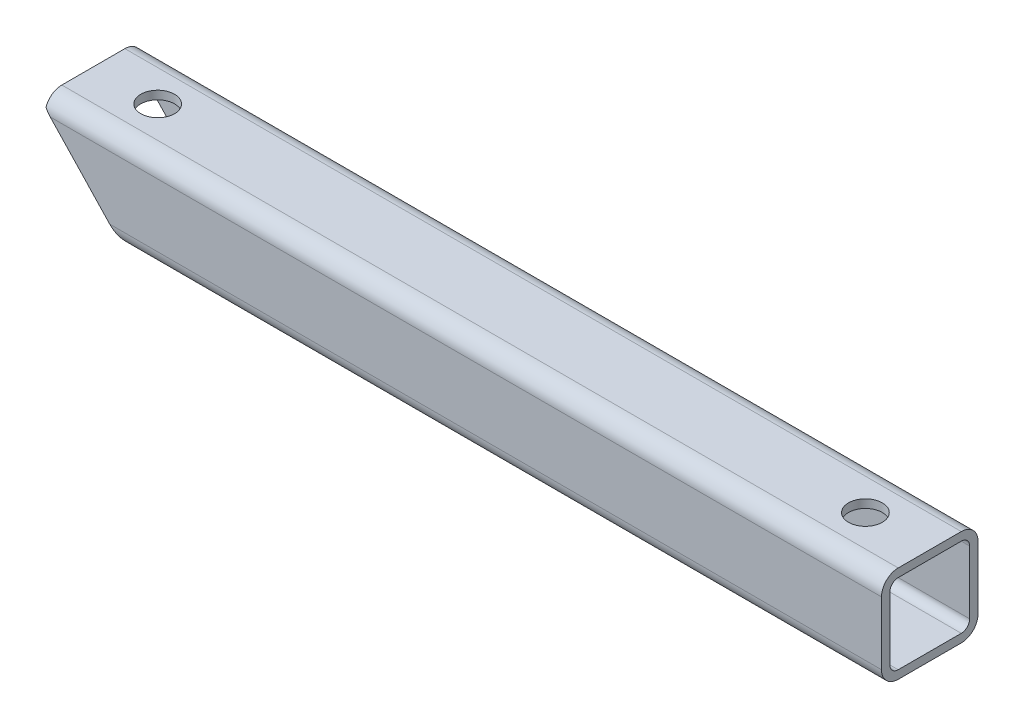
ISO-10303-21;
HEADER;
FILE_DESCRIPTION(('STEP AP214'),'2;1');
FILE_NAME('part.step','',(''),(''),'','','');
FILE_SCHEMA(('AUTOMOTIVE_DESIGN { 1 0 10303 214 1 1 1 1 }'));
ENDSEC;
DATA;
#1=APPLICATION_CONTEXT('core data for automotive mechanical design processes');
#2=APPLICATION_PROTOCOL_DEFINITION('international standard','automotive_design',2000,#1);
#3=PRODUCT_CONTEXT('',#1,'mechanical');
#4=PRODUCT('Part','Part','',(#3));
#5=PRODUCT_RELATED_PRODUCT_CATEGORY('part','',(#4));
#6=PRODUCT_DEFINITION_FORMATION('','',#4);
#7=PRODUCT_DEFINITION_CONTEXT('part definition',#1,'design');
#8=PRODUCT_DEFINITION('design','',#6,#7);
#9=PRODUCT_DEFINITION_SHAPE('','',#8);
#10=(LENGTH_UNIT() NAMED_UNIT(*) SI_UNIT(.MILLI.,.METRE.));
#11=(NAMED_UNIT(*) PLANE_ANGLE_UNIT() SI_UNIT($,.RADIAN.));
#12=(NAMED_UNIT(*) SI_UNIT($,.STERADIAN.) SOLID_ANGLE_UNIT());
#13=UNCERTAINTY_MEASURE_WITH_UNIT(LENGTH_MEASURE(1.E-05),#10,'distance_accuracy_value','');
#14=(GEOMETRIC_REPRESENTATION_CONTEXT(3) GLOBAL_UNCERTAINTY_ASSIGNED_CONTEXT((#13)) GLOBAL_UNIT_ASSIGNED_CONTEXT((#10,
#11,#12)) REPRESENTATION_CONTEXT('',''));
#15=CARTESIAN_POINT('',(0.,0.,0.));
#16=DIRECTION('',(0.,0.,1.));
#17=DIRECTION('',(1.,0.,0.));
#18=AXIS2_PLACEMENT_3D('',#15,#16,#17);
#19=CARTESIAN_POINT('',(130.,9.8,-9.8));
#20=DIRECTION('',(-1.,0.,0.));
#21=DIRECTION('',(0.,0.,1.));
#22=AXIS2_PLACEMENT_3D('',#19,#20,#21);
#23=CYLINDRICAL_SURFACE('',#22,5.2);
#24=DIRECTION('',(-1.,0.,0.));
#25=VECTOR('',#24,1.);
#26=CARTESIAN_POINT('',(130.,9.8,-15.));
#27=LINE('',#26,#25);
#28=CARTESIAN_POINT('',(130.,9.8,-15.));
#29=VERTEX_POINT('',#28);
#30=CARTESIAN_POINT('',(-128.396226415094,9.8,-15.));
#31=VERTEX_POINT('',#30);
#32=EDGE_CURVE('E186',#29,#31,#27,.T.);
#33=ORIENTED_EDGE('',*,*,#32,.T.);
#34=CARTESIAN_POINT('',(-128.396226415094,9.8,-9.8));
#35=DIRECTION('',(0.727393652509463,0.686220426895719,0.));
#36=DIRECTION('',(-0.686220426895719,0.727393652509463,0.));
#37=AXIS2_PLACEMENT_3D('',#34,#35,#36);
#38=ELLIPSE('',#37,7.14881135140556,5.2);
#39=CARTESIAN_POINT('',(-130.,11.5,-14.7142649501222));
#40=VERTEX_POINT('',#39);
#41=EDGE_CURVE('E168',#31,#40,#38,.T.);
#42=ORIENTED_EDGE('',*,*,#41,.T.);
#43=CARTESIAN_POINT('',(-130.,9.8,-9.8));
#44=DIRECTION('',(1.,0.,0.));
#45=DIRECTION('',(0.,0.,-1.));
#46=AXIS2_PLACEMENT_3D('',#43,#44,#45);
#47=CIRCLE('',#46,5.2);
#48=CARTESIAN_POINT('',(-130.,15.,-9.8));
#49=VERTEX_POINT('',#48);
#50=EDGE_CURVE('E277',#40,#49,#47,.T.);
#51=ORIENTED_EDGE('',*,*,#50,.T.);
#52=DIRECTION('',(-1.,0.,0.));
#53=VECTOR('',#52,1.);
#54=CARTESIAN_POINT('',(130.,15.,-9.8));
#55=LINE('',#54,#53);
#56=CARTESIAN_POINT('',(130.,15.,-9.8));
#57=VERTEX_POINT('',#56);
#58=EDGE_CURVE('E219',#57,#49,#55,.T.);
#59=ORIENTED_EDGE('',*,*,#58,.F.);
#60=CARTESIAN_POINT('',(130.,9.8,-9.8));
#61=DIRECTION('',(1.,0.,0.));
#62=DIRECTION('',(0.,0.,-1.));
#63=AXIS2_PLACEMENT_3D('',#60,#61,#62);
#64=CIRCLE('',#63,5.2);
#65=EDGE_CURVE('E194',#29,#57,#64,.T.);
#66=ORIENTED_EDGE('',*,*,#65,.F.);
#67=EDGE_LOOP('',(#33,#42,#51,#59,#66));
#68=FACE_BOUND('',#67,.T.);
#69=ADVANCED_FACE('F34',(#68),#23,.T.);
#70=CARTESIAN_POINT('',(130.,15.,-9.8));
#71=DIRECTION('',(0.,-1.,0.));
#72=DIRECTION('',(0.,0.,-1.));
#73=AXIS2_PLACEMENT_3D('',#70,#71,#72);
#74=PLANE('',#73);
#75=CARTESIAN_POINT('',(-110.,15.,0.));
#76=DIRECTION('',(0.,1.,0.));
#77=DIRECTION('',(0.,0.,1.));
#78=AXIS2_PLACEMENT_3D('',#75,#76,#77);
#79=CIRCLE('',#78,5.25);
#80=CARTESIAN_POINT('',(-110.,15.,5.25));
#81=VERTEX_POINT('',#80);
#82=EDGE_CURVE('E178',#81,#81,#79,.T.);
#83=ORIENTED_EDGE('',*,*,#82,.F.);
#84=EDGE_LOOP('',(#83));
#85=FACE_BOUND('',#84,.T.);
#86=CARTESIAN_POINT('',(110.,15.,0.));
#87=DIRECTION('',(0.,1.,0.));
#88=DIRECTION('',(0.,0.,1.));
#89=AXIS2_PLACEMENT_3D('',#86,#87,#88);
#90=CIRCLE('',#89,5.25);
#91=CARTESIAN_POINT('',(110.,15.,5.25));
#92=VERTEX_POINT('',#91);
#93=EDGE_CURVE('E253',#92,#92,#90,.T.);
#94=ORIENTED_EDGE('',*,*,#93,.F.);
#95=EDGE_LOOP('',(#94));
#96=FACE_BOUND('',#95,.T.);
#97=DIRECTION('',(0.,0.,1.));
#98=VECTOR('',#97,1.);
#99=CARTESIAN_POINT('',(-130.,15.,-9.8));
#100=LINE('',#99,#98);
#101=CARTESIAN_POINT('',(-130.,15.,9.8));
#102=VERTEX_POINT('',#101);
#103=EDGE_CURVE('E279',#49,#102,#100,.T.);
#104=ORIENTED_EDGE('',*,*,#103,.T.);
#105=DIRECTION('',(-1.,0.,0.));
#106=VECTOR('',#105,1.);
#107=CARTESIAN_POINT('',(130.,15.,9.8));
#108=LINE('',#107,#106);
#109=CARTESIAN_POINT('',(130.,15.,9.8));
#110=VERTEX_POINT('',#109);
#111=EDGE_CURVE('E216',#110,#102,#108,.T.);
#112=ORIENTED_EDGE('',*,*,#111,.F.);
#113=DIRECTION('',(0.,0.,1.));
#114=VECTOR('',#113,1.);
#115=CARTESIAN_POINT('',(130.,15.,-9.8));
#116=LINE('',#115,#114);
#117=EDGE_CURVE('E309',#57,#110,#116,.T.);
#118=ORIENTED_EDGE('',*,*,#117,.F.);
#119=ORIENTED_EDGE('',*,*,#58,.T.);
#120=EDGE_LOOP('',(#104,#112,#118,#119));
#121=FACE_BOUND('',#120,.T.);
#122=ADVANCED_FACE('F325',(#85,#96,#121),#74,.F.);
#123=CARTESIAN_POINT('',(130.,9.8,9.8));
#124=DIRECTION('',(-1.,0.,0.));
#125=DIRECTION('',(0.,0.,1.));
#126=AXIS2_PLACEMENT_3D('',#123,#124,#125);
#127=CYLINDRICAL_SURFACE('',#126,5.2);
#128=CARTESIAN_POINT('',(-130.,9.8,9.8));
#129=DIRECTION('',(1.,0.,0.));
#130=DIRECTION('',(0.,0.,-1.));
#131=AXIS2_PLACEMENT_3D('',#128,#129,#130);
#132=CIRCLE('',#131,5.2);
#133=CARTESIAN_POINT('',(-130.,11.5,14.7142649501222));
#134=VERTEX_POINT('',#133);
#135=EDGE_CURVE('E281',#102,#134,#132,.T.);
#136=ORIENTED_EDGE('',*,*,#135,.T.);
#137=CARTESIAN_POINT('',(-128.396226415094,9.8,9.8));
#138=DIRECTION('',(0.727393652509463,0.686220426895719,0.));
#139=DIRECTION('',(-0.686220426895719,0.727393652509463,0.));
#140=AXIS2_PLACEMENT_3D('',#137,#138,#139);
#141=ELLIPSE('',#140,7.14881135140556,5.2);
#142=CARTESIAN_POINT('',(-128.396226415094,9.80000000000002,15.));
#143=VERTEX_POINT('',#142);
#144=EDGE_CURVE('E179',#134,#143,#141,.T.);
#145=ORIENTED_EDGE('',*,*,#144,.T.);
#146=DIRECTION('',(-1.,0.,0.));
#147=VECTOR('',#146,1.);
#148=CARTESIAN_POINT('',(130.,9.8,15.));
#149=LINE('',#148,#147);
#150=CARTESIAN_POINT('',(130.,9.8,15.));
#151=VERTEX_POINT('',#150);
#152=EDGE_CURVE('E213',#151,#143,#149,.T.);
#153=ORIENTED_EDGE('',*,*,#152,.F.);
#154=CARTESIAN_POINT('',(130.,9.8,9.8));
#155=DIRECTION('',(1.,0.,0.));
#156=DIRECTION('',(0.,0.,-1.));
#157=AXIS2_PLACEMENT_3D('',#154,#155,#156);
#158=CIRCLE('',#157,5.2);
#159=EDGE_CURVE('E311',#110,#151,#158,.T.);
#160=ORIENTED_EDGE('',*,*,#159,.F.);
#161=ORIENTED_EDGE('',*,*,#111,.T.);
#162=EDGE_LOOP('',(#136,#145,#153,#160,#161));
#163=FACE_BOUND('',#162,.T.);
#164=ADVANCED_FACE('F330',(#163),#127,.T.);
#165=CARTESIAN_POINT('',(130.,-9.8,15.));
#166=DIRECTION('',(0.,0.,-1.));
#167=DIRECTION('',(-1.,0.,0.));
#168=AXIS2_PLACEMENT_3D('',#165,#166,#167);
#169=PLANE('',#168);
#170=ORIENTED_EDGE('',*,*,#152,.T.);
#171=DIRECTION('',(0.686220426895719,-0.727393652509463,0.));
#172=VECTOR('',#171,1.);
#173=CARTESIAN_POINT('',(-130.,11.5,15.));
#174=LINE('',#173,#172);
#175=CARTESIAN_POINT('',(-109.905660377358,-9.8,15.));
#176=VERTEX_POINT('',#175);
#177=EDGE_CURVE('E190',#143,#176,#174,.T.);
#178=ORIENTED_EDGE('',*,*,#177,.T.);
#179=DIRECTION('',(-1.,0.,0.));
#180=VECTOR('',#179,1.);
#181=CARTESIAN_POINT('',(130.,-9.8,15.));
#182=LINE('',#181,#180);
#183=CARTESIAN_POINT('',(130.,-9.8,15.));
#184=VERTEX_POINT('',#183);
#185=EDGE_CURVE('E210',#184,#176,#182,.T.);
#186=ORIENTED_EDGE('',*,*,#185,.F.);
#187=DIRECTION('',(0.,-1.,0.));
#188=VECTOR('',#187,1.);
#189=CARTESIAN_POINT('',(130.,-9.8,15.));
#190=LINE('',#189,#188);
#191=EDGE_CURVE('E313',#151,#184,#190,.T.);
#192=ORIENTED_EDGE('',*,*,#191,.F.);
#193=EDGE_LOOP('',(#170,#178,#186,#192));
#194=FACE_BOUND('',#193,.T.);
#195=ADVANCED_FACE('F338',(#194),#169,.F.);
#196=CARTESIAN_POINT('',(130.,-9.8,9.8));
#197=DIRECTION('',(-1.,0.,0.));
#198=DIRECTION('',(0.,0.,1.));
#199=AXIS2_PLACEMENT_3D('',#196,#197,#198);
#200=CYLINDRICAL_SURFACE('',#199,5.2);
#201=ORIENTED_EDGE('',*,*,#185,.T.);
#202=CARTESIAN_POINT('',(-109.905660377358,-9.8,9.8));
#203=DIRECTION('',(0.727393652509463,0.686220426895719,0.));
#204=DIRECTION('',(-0.686220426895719,0.727393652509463,0.));
#205=AXIS2_PLACEMENT_3D('',#202,#203,#204);
#206=ELLIPSE('',#205,7.14881135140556,5.2);
#207=CARTESIAN_POINT('',(-105.,-15.,9.8));
#208=VERTEX_POINT('',#207);
#209=EDGE_CURVE('E343',#176,#208,#206,.T.);
#210=ORIENTED_EDGE('',*,*,#209,.T.);
#211=DIRECTION('',(-1.,0.,0.));
#212=VECTOR('',#211,1.);
#213=CARTESIAN_POINT('',(130.,-15.,9.8));
#214=LINE('',#213,#212);
#215=CARTESIAN_POINT('',(130.,-15.,9.8));
#216=VERTEX_POINT('',#215);
#217=EDGE_CURVE('E207',#216,#208,#214,.T.);
#218=ORIENTED_EDGE('',*,*,#217,.F.);
#219=CARTESIAN_POINT('',(130.,-9.8,9.8));
#220=DIRECTION('',(1.,0.,0.));
#221=DIRECTION('',(0.,0.,-1.));
#222=AXIS2_PLACEMENT_3D('',#219,#220,#221);
#223=CIRCLE('',#222,5.2);
#224=EDGE_CURVE('E315',#184,#216,#223,.T.);
#225=ORIENTED_EDGE('',*,*,#224,.F.);
#226=EDGE_LOOP('',(#201,#210,#218,#225));
#227=FACE_BOUND('',#226,.T.);
#228=ADVANCED_FACE('F341',(#227),#200,.T.);
#229=CARTESIAN_POINT('',(130.,-15.,9.8));
#230=DIRECTION('',(0.,1.,0.));
#231=DIRECTION('',(0.,0.,1.));
#232=AXIS2_PLACEMENT_3D('',#229,#230,#231);
#233=PLANE('',#232);
#234=ORIENTED_EDGE('',*,*,#217,.T.);
#235=DIRECTION('',(0.,0.,-1.));
#236=VECTOR('',#235,1.);
#237=CARTESIAN_POINT('',(-105.,-15.,15.));
#238=LINE('',#237,#236);
#239=CARTESIAN_POINT('',(-105.,-15.,1.60078105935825));
#240=VERTEX_POINT('',#239);
#241=EDGE_CURVE('E365',#208,#240,#238,.T.);
#242=ORIENTED_EDGE('',*,*,#241,.T.);
#243=CARTESIAN_POINT('',(-110.,-15.,0.));
#244=DIRECTION('',(0.,1.,0.));
#245=DIRECTION('',(0.,0.,1.));
#246=AXIS2_PLACEMENT_3D('',#243,#244,#245);
#247=CIRCLE('',#246,5.25);
#248=CARTESIAN_POINT('',(-105.,-15.,-1.60078105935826));
#249=VERTEX_POINT('',#248);
#250=EDGE_CURVE('E249',#240,#249,#247,.T.);
#251=ORIENTED_EDGE('',*,*,#250,.T.);
#252=CARTESIAN_POINT('',(-105.,-15.,-9.8));
#253=VERTEX_POINT('',#252);
#254=EDGE_CURVE('E49',#249,#253,#238,.T.);
#255=ORIENTED_EDGE('',*,*,#254,.T.);
#256=DIRECTION('',(-1.,0.,0.));
#257=VECTOR('',#256,1.);
#258=CARTESIAN_POINT('',(130.,-15.,-9.8));
#259=LINE('',#258,#257);
#260=CARTESIAN_POINT('',(130.,-15.,-9.8));
#261=VERTEX_POINT('',#260);
#262=EDGE_CURVE('E197',#261,#253,#259,.T.);
#263=ORIENTED_EDGE('',*,*,#262,.F.);
#264=DIRECTION('',(0.,0.,-1.));
#265=VECTOR('',#264,1.);
#266=CARTESIAN_POINT('',(130.,-15.,9.8));
#267=LINE('',#266,#265);
#268=EDGE_CURVE('E317',#216,#261,#267,.T.);
#269=ORIENTED_EDGE('',*,*,#268,.F.);
#270=EDGE_LOOP('',(#234,#242,#251,#255,#263,#269));
#271=FACE_BOUND('',#270,.T.);
#272=CARTESIAN_POINT('',(110.,-15.,0.));
#273=DIRECTION('',(0.,1.,0.));
#274=DIRECTION('',(0.,0.,1.));
#275=AXIS2_PLACEMENT_3D('',#272,#273,#274);
#276=CIRCLE('',#275,5.25);
#277=CARTESIAN_POINT('',(110.,-15.,5.25));
#278=VERTEX_POINT('',#277);
#279=EDGE_CURVE('E245',#278,#278,#276,.T.);
#280=ORIENTED_EDGE('',*,*,#279,.T.);
#281=EDGE_LOOP('',(#280));
#282=FACE_BOUND('',#281,.T.);
#283=ADVANCED_FACE('F345',(#271,#282),#233,.F.);
#284=CARTESIAN_POINT('',(130.,-9.8,-9.8));
#285=DIRECTION('',(-1.,0.,0.));
#286=DIRECTION('',(0.,0.,1.));
#287=AXIS2_PLACEMENT_3D('',#284,#285,#286);
#288=CYLINDRICAL_SURFACE('',#287,5.2);
#289=ORIENTED_EDGE('',*,*,#262,.T.);
#290=CARTESIAN_POINT('',(-109.905660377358,-9.8,-9.8));
#291=DIRECTION('',(0.727393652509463,0.686220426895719,0.));
#292=DIRECTION('',(-0.686220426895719,0.727393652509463,0.));
#293=AXIS2_PLACEMENT_3D('',#290,#291,#292);
#294=ELLIPSE('',#293,7.14881135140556,5.2);
#295=CARTESIAN_POINT('',(-109.905660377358,-9.8,-15.));
#296=VERTEX_POINT('',#295);
#297=EDGE_CURVE('E349',#253,#296,#294,.T.);
#298=ORIENTED_EDGE('',*,*,#297,.T.);
#299=DIRECTION('',(-1.,0.,0.));
#300=VECTOR('',#299,1.);
#301=CARTESIAN_POINT('',(130.,-9.8,-15.));
#302=LINE('',#301,#300);
#303=CARTESIAN_POINT('',(130.,-9.8,-15.));
#304=VERTEX_POINT('',#303);
#305=EDGE_CURVE('E189',#304,#296,#302,.T.);
#306=ORIENTED_EDGE('',*,*,#305,.F.);
#307=CARTESIAN_POINT('',(130.,-9.8,-9.8));
#308=DIRECTION('',(1.,0.,0.));
#309=DIRECTION('',(0.,0.,-1.));
#310=AXIS2_PLACEMENT_3D('',#307,#308,#309);
#311=CIRCLE('',#310,5.2);
#312=EDGE_CURVE('E318',#261,#304,#311,.T.);
#313=ORIENTED_EDGE('',*,*,#312,.F.);
#314=EDGE_LOOP('',(#289,#298,#306,#313));
#315=FACE_BOUND('',#314,.T.);
#316=ADVANCED_FACE('F348',(#315),#288,.T.);
#317=CARTESIAN_POINT('',(130.,9.8,9.8));
#318=DIRECTION('',(-1.,0.,0.));
#319=DIRECTION('',(0.,0.,1.));
#320=AXIS2_PLACEMENT_3D('',#317,#318,#319);
#321=CYLINDRICAL_SURFACE('',#320,2.6);
#322=CARTESIAN_POINT('',(-128.396226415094,9.8,9.8));
#323=DIRECTION('',(0.727393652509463,0.686220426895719,0.));
#324=DIRECTION('',(-0.686220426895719,0.727393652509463,0.));
#325=AXIS2_PLACEMENT_3D('',#322,#323,#324);
#326=ELLIPSE('',#325,3.57440567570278,2.6);
#327=CARTESIAN_POINT('',(-130.,11.5,11.7672315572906));
#328=VERTEX_POINT('',#327);
#329=CARTESIAN_POINT('',(-128.396226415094,9.8,12.4));
#330=VERTEX_POINT('',#329);
#331=EDGE_CURVE('E375',#328,#330,#326,.T.);
#332=ORIENTED_EDGE('',*,*,#331,.F.);
#333=CARTESIAN_POINT('',(-130.,9.8,9.8));
#334=DIRECTION('',(1.,0.,0.));
#335=DIRECTION('',(0.,0.,-1.));
#336=AXIS2_PLACEMENT_3D('',#333,#334,#335);
#337=CIRCLE('',#336,2.6);
#338=CARTESIAN_POINT('',(-130.,12.4,9.8));
#339=VERTEX_POINT('',#338);
#340=EDGE_CURVE('E269',#339,#328,#337,.T.);
#341=ORIENTED_EDGE('',*,*,#340,.F.);
#342=DIRECTION('',(-1.,0.,0.));
#343=VECTOR('',#342,1.);
#344=CARTESIAN_POINT('',(130.,12.4,9.8));
#345=LINE('',#344,#343);
#346=CARTESIAN_POINT('',(130.,12.4,9.8));
#347=VERTEX_POINT('',#346);
#348=EDGE_CURVE('E195',#347,#339,#345,.T.);
#349=ORIENTED_EDGE('',*,*,#348,.F.);
#350=CARTESIAN_POINT('',(130.,9.8,9.8));
#351=DIRECTION('',(1.,0.,0.));
#352=DIRECTION('',(0.,0.,-1.));
#353=AXIS2_PLACEMENT_3D('',#350,#351,#352);
#354=CIRCLE('',#353,2.6);
#355=CARTESIAN_POINT('',(130.,9.8,12.4));
#356=VERTEX_POINT('',#355);
#357=EDGE_CURVE('E284',#347,#356,#354,.T.);
#358=ORIENTED_EDGE('',*,*,#357,.T.);
#359=DIRECTION('',(-1.,0.,0.));
#360=VECTOR('',#359,1.);
#361=CARTESIAN_POINT('',(130.,9.8,12.4));
#362=LINE('',#361,#360);
#363=EDGE_CURVE('E222',#356,#330,#362,.T.);
#364=ORIENTED_EDGE('',*,*,#363,.T.);
#365=EDGE_LOOP('',(#332,#341,#349,#358,#364));
#366=FACE_BOUND('',#365,.T.);
#367=ADVANCED_FACE('F36',(#366),#321,.F.);
#368=CARTESIAN_POINT('',(130.,12.4,-9.8));
#369=DIRECTION('',(0.,-1.,0.));
#370=DIRECTION('',(0.,0.,-1.));
#371=AXIS2_PLACEMENT_3D('',#368,#369,#370);
#372=PLANE('',#371);
#373=CARTESIAN_POINT('',(-110.,12.4,0.));
#374=DIRECTION('',(0.,-1.,0.));
#375=DIRECTION('',(0.,0.,-1.));
#376=AXIS2_PLACEMENT_3D('',#373,#374,#375);
#377=CIRCLE('',#376,5.25);
#378=CARTESIAN_POINT('',(-110.,12.4,-5.25));
#379=VERTEX_POINT('',#378);
#380=EDGE_CURVE('E248',#379,#379,#377,.T.);
#381=ORIENTED_EDGE('',*,*,#380,.F.);
#382=EDGE_LOOP('',(#381));
#383=FACE_BOUND('',#382,.T.);
#384=CARTESIAN_POINT('',(110.,12.4,0.));
#385=DIRECTION('',(0.,-1.,0.));
#386=DIRECTION('',(0.,0.,-1.));
#387=AXIS2_PLACEMENT_3D('',#384,#385,#386);
#388=CIRCLE('',#387,5.25);
#389=CARTESIAN_POINT('',(110.,12.4,-5.25));
#390=VERTEX_POINT('',#389);
#391=EDGE_CURVE('E244',#390,#390,#388,.T.);
#392=ORIENTED_EDGE('',*,*,#391,.F.);
#393=EDGE_LOOP('',(#392));
#394=FACE_BOUND('',#393,.T.);
#395=DIRECTION('',(0.,0.,1.));
#396=VECTOR('',#395,1.);
#397=CARTESIAN_POINT('',(-130.,12.4,-9.8));
#398=LINE('',#397,#396);
#399=CARTESIAN_POINT('',(-130.,12.4,-9.8));
#400=VERTEX_POINT('',#399);
#401=EDGE_CURVE('E272',#400,#339,#398,.T.);
#402=ORIENTED_EDGE('',*,*,#401,.F.);
#403=DIRECTION('',(-1.,0.,0.));
#404=VECTOR('',#403,1.);
#405=CARTESIAN_POINT('',(130.,12.4,-9.8));
#406=LINE('',#405,#404);
#407=CARTESIAN_POINT('',(130.,12.4,-9.8));
#408=VERTEX_POINT('',#407);
#409=EDGE_CURVE('E199',#408,#400,#406,.T.);
#410=ORIENTED_EDGE('',*,*,#409,.F.);
#411=DIRECTION('',(0.,0.,1.));
#412=VECTOR('',#411,1.);
#413=CARTESIAN_POINT('',(130.,12.4,-9.8));
#414=LINE('',#413,#412);
#415=EDGE_CURVE('E287',#408,#347,#414,.T.);
#416=ORIENTED_EDGE('',*,*,#415,.T.);
#417=ORIENTED_EDGE('',*,*,#348,.T.);
#418=EDGE_LOOP('',(#402,#410,#416,#417));
#419=FACE_BOUND('',#418,.T.);
#420=ADVANCED_FACE('F410',(#383,#394,#419),#372,.T.);
#421=CARTESIAN_POINT('',(130.,9.8,-9.8));
#422=DIRECTION('',(-1.,0.,0.));
#423=DIRECTION('',(0.,0.,1.));
#424=AXIS2_PLACEMENT_3D('',#421,#422,#423);
#425=CYLINDRICAL_SURFACE('',#424,2.6);
#426=CARTESIAN_POINT('',(-128.396226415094,9.8,-9.8));
#427=DIRECTION('',(0.727393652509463,0.686220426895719,0.));
#428=DIRECTION('',(-0.686220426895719,0.727393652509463,0.));
#429=AXIS2_PLACEMENT_3D('',#426,#427,#428);
#430=ELLIPSE('',#429,3.57440567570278,2.6);
#431=CARTESIAN_POINT('',(-128.396226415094,9.8,-12.4));
#432=VERTEX_POINT('',#431);
#433=CARTESIAN_POINT('',(-130.,11.5,-11.7672315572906));
#434=VERTEX_POINT('',#433);
#435=EDGE_CURVE('E350',#432,#434,#430,.T.);
#436=ORIENTED_EDGE('',*,*,#435,.F.);
#437=DIRECTION('',(-1.,0.,0.));
#438=VECTOR('',#437,1.);
#439=CARTESIAN_POINT('',(130.,9.8,-12.4));
#440=LINE('',#439,#438);
#441=CARTESIAN_POINT('',(130.,9.8,-12.4));
#442=VERTEX_POINT('',#441);
#443=EDGE_CURVE('E237',#442,#432,#440,.T.);
#444=ORIENTED_EDGE('',*,*,#443,.F.);
#445=CARTESIAN_POINT('',(130.,9.8,-9.8));
#446=DIRECTION('',(1.,0.,0.));
#447=DIRECTION('',(0.,0.,-1.));
#448=AXIS2_PLACEMENT_3D('',#445,#446,#447);
#449=CIRCLE('',#448,2.6);
#450=EDGE_CURVE('E290',#442,#408,#449,.T.);
#451=ORIENTED_EDGE('',*,*,#450,.T.);
#452=ORIENTED_EDGE('',*,*,#409,.T.);
#453=CARTESIAN_POINT('',(-130.,9.8,-9.8));
#454=DIRECTION('',(1.,0.,0.));
#455=DIRECTION('',(0.,0.,-1.));
#456=AXIS2_PLACEMENT_3D('',#453,#454,#455);
#457=CIRCLE('',#456,2.6);
#458=EDGE_CURVE('E275',#434,#400,#457,.T.);
#459=ORIENTED_EDGE('',*,*,#458,.F.);
#460=EDGE_LOOP('',(#436,#444,#451,#452,#459));
#461=FACE_BOUND('',#460,.T.);
#462=ADVANCED_FACE('F384',(#461),#425,.F.);
#463=CARTESIAN_POINT('',(130.,9.8,-12.4));
#464=DIRECTION('',(0.,0.,1.));
#465=DIRECTION('',(1.,0.,0.));
#466=AXIS2_PLACEMENT_3D('',#463,#464,#465);
#467=PLANE('',#466);
#468=DIRECTION('',(-0.686220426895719,0.727393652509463,0.));
#469=VECTOR('',#468,1.);
#470=CARTESIAN_POINT('',(-6.71783763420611,-119.179092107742,-12.4));
#471=LINE('',#470,#469);
#472=CARTESIAN_POINT('',(-109.905660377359,-9.8,-12.4));
#473=VERTEX_POINT('',#472);
#474=EDGE_CURVE('E353',#473,#432,#471,.T.);
#475=ORIENTED_EDGE('',*,*,#474,.F.);
#476=DIRECTION('',(-1.,0.,0.));
#477=VECTOR('',#476,1.);
#478=CARTESIAN_POINT('',(130.,-9.8,-12.4));
#479=LINE('',#478,#477);
#480=CARTESIAN_POINT('',(130.,-9.8,-12.4));
#481=VERTEX_POINT('',#480);
#482=EDGE_CURVE('E234',#481,#473,#479,.T.);
#483=ORIENTED_EDGE('',*,*,#482,.F.);
#484=DIRECTION('',(0.,1.,0.));
#485=VECTOR('',#484,1.);
#486=CARTESIAN_POINT('',(130.,9.8,-12.4));
#487=LINE('',#486,#485);
#488=EDGE_CURVE('E293',#481,#442,#487,.T.);
#489=ORIENTED_EDGE('',*,*,#488,.T.);
#490=ORIENTED_EDGE('',*,*,#443,.T.);
#491=EDGE_LOOP('',(#475,#483,#489,#490));
#492=FACE_BOUND('',#491,.T.);
#493=ADVANCED_FACE('F386',(#492),#467,.T.);
#494=CARTESIAN_POINT('',(130.,-9.8,-9.8));
#495=DIRECTION('',(-1.,0.,0.));
#496=DIRECTION('',(0.,0.,1.));
#497=AXIS2_PLACEMENT_3D('',#494,#495,#496);
#498=CYLINDRICAL_SURFACE('',#497,2.6);
#499=CARTESIAN_POINT('',(-109.905660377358,-9.8,-9.8));
#500=DIRECTION('',(0.727393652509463,0.686220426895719,0.));
#501=DIRECTION('',(-0.686220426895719,0.727393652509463,0.));
#502=AXIS2_PLACEMENT_3D('',#499,#500,#501);
#503=ELLIPSE('',#502,3.57440567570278,2.6);
#504=CARTESIAN_POINT('',(-107.452830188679,-12.4,-9.8));
#505=VERTEX_POINT('',#504);
#506=EDGE_CURVE('E377',#505,#473,#503,.T.);
#507=ORIENTED_EDGE('',*,*,#506,.F.);
#508=DIRECTION('',(-1.,0.,0.));
#509=VECTOR('',#508,1.);
#510=CARTESIAN_POINT('',(130.,-12.4,-9.8));
#511=LINE('',#510,#509);
#512=CARTESIAN_POINT('',(130.,-12.4,-9.8));
#513=VERTEX_POINT('',#512);
#514=EDGE_CURVE('E231',#513,#505,#511,.T.);
#515=ORIENTED_EDGE('',*,*,#514,.F.);
#516=CARTESIAN_POINT('',(130.,-9.8,-9.8));
#517=DIRECTION('',(1.,0.,0.));
#518=DIRECTION('',(0.,0.,-1.));
#519=AXIS2_PLACEMENT_3D('',#516,#517,#518);
#520=CIRCLE('',#519,2.6);
#521=EDGE_CURVE('E296',#513,#481,#520,.T.);
#522=ORIENTED_EDGE('',*,*,#521,.T.);
#523=ORIENTED_EDGE('',*,*,#482,.T.);
#524=EDGE_LOOP('',(#507,#515,#522,#523));
#525=FACE_BOUND('',#524,.T.);
#526=ADVANCED_FACE('F394',(#525),#498,.F.);
#527=CARTESIAN_POINT('',(130.,-12.4,9.8));
#528=DIRECTION('',(0.,1.,0.));
#529=DIRECTION('',(0.,0.,1.));
#530=AXIS2_PLACEMENT_3D('',#527,#528,#529);
#531=PLANE('',#530);
#532=DIRECTION('',(0.,0.,-1.));
#533=VECTOR('',#532,1.);
#534=CARTESIAN_POINT('',(-107.452830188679,-12.4,9.8));
#535=LINE('',#534,#533);
#536=CARTESIAN_POINT('',(-107.452830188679,-12.4,9.8));
#537=VERTEX_POINT('',#536);
#538=CARTESIAN_POINT('',(-107.452830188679,-12.4,4.59068904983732));
#539=VERTEX_POINT('',#538);
#540=EDGE_CURVE('E56',#537,#539,#535,.T.);
#541=ORIENTED_EDGE('',*,*,#540,.F.);
#542=DIRECTION('',(-1.,0.,0.));
#543=VECTOR('',#542,1.);
#544=CARTESIAN_POINT('',(130.,-12.4,9.8));
#545=LINE('',#544,#543);
#546=CARTESIAN_POINT('',(130.,-12.4,9.8));
#547=VERTEX_POINT('',#546);
#548=EDGE_CURVE('E228',#547,#537,#545,.T.);
#549=ORIENTED_EDGE('',*,*,#548,.F.);
#550=DIRECTION('',(0.,0.,-1.));
#551=VECTOR('',#550,1.);
#552=CARTESIAN_POINT('',(130.,-12.4,9.8));
#553=LINE('',#552,#551);
#554=EDGE_CURVE('E299',#547,#513,#553,.T.);
#555=ORIENTED_EDGE('',*,*,#554,.T.);
#556=ORIENTED_EDGE('',*,*,#514,.T.);
#557=CARTESIAN_POINT('',(-107.452830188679,-12.4,-4.59068904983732));
#558=VERTEX_POINT('',#557);
#559=EDGE_CURVE('E371',#558,#505,#535,.T.);
#560=ORIENTED_EDGE('',*,*,#559,.F.);
#561=CARTESIAN_POINT('',(-110.,-12.4,0.));
#562=DIRECTION('',(0.,1.,0.));
#563=DIRECTION('',(0.,0.,1.));
#564=AXIS2_PLACEMENT_3D('',#561,#562,#563);
#565=CIRCLE('',#564,5.25);
#566=EDGE_CURVE('E246',#539,#558,#565,.T.);
#567=ORIENTED_EDGE('',*,*,#566,.F.);
#568=EDGE_LOOP('',(#541,#549,#555,#556,#560,#567));
#569=FACE_BOUND('',#568,.T.);
#570=CARTESIAN_POINT('',(110.,-12.4,0.));
#571=DIRECTION('',(0.,1.,0.));
#572=DIRECTION('',(0.,0.,1.));
#573=AXIS2_PLACEMENT_3D('',#570,#571,#572);
#574=CIRCLE('',#573,5.25);
#575=CARTESIAN_POINT('',(110.,-12.4,5.25));
#576=VERTEX_POINT('',#575);
#577=EDGE_CURVE('E242',#576,#576,#574,.T.);
#578=ORIENTED_EDGE('',*,*,#577,.F.);
#579=EDGE_LOOP('',(#578));
#580=FACE_BOUND('',#579,.T.);
#581=ADVANCED_FACE('F397',(#569,#580),#531,.T.);
#582=CARTESIAN_POINT('',(130.,-9.8,9.8));
#583=DIRECTION('',(-1.,0.,0.));
#584=DIRECTION('',(0.,0.,1.));
#585=AXIS2_PLACEMENT_3D('',#582,#583,#584);
#586=CYLINDRICAL_SURFACE('',#585,2.6);
#587=CARTESIAN_POINT('',(-109.905660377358,-9.8,9.8));
#588=DIRECTION('',(0.727393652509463,0.686220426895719,0.));
#589=DIRECTION('',(-0.686220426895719,0.727393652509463,0.));
#590=AXIS2_PLACEMENT_3D('',#587,#588,#589);
#591=ELLIPSE('',#590,3.57440567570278,2.6);
#592=CARTESIAN_POINT('',(-109.905660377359,-9.8,12.4));
#593=VERTEX_POINT('',#592);
#594=EDGE_CURVE('E370',#593,#537,#591,.T.);
#595=ORIENTED_EDGE('',*,*,#594,.F.);
#596=DIRECTION('',(-1.,0.,0.));
#597=VECTOR('',#596,1.);
#598=CARTESIAN_POINT('',(130.,-9.8,12.4));
#599=LINE('',#598,#597);
#600=CARTESIAN_POINT('',(130.,-9.8,12.4));
#601=VERTEX_POINT('',#600);
#602=EDGE_CURVE('E225',#601,#593,#599,.T.);
#603=ORIENTED_EDGE('',*,*,#602,.F.);
#604=CARTESIAN_POINT('',(130.,-9.8,9.8));
#605=DIRECTION('',(1.,0.,0.));
#606=DIRECTION('',(0.,0.,-1.));
#607=AXIS2_PLACEMENT_3D('',#604,#605,#606);
#608=CIRCLE('',#607,2.6);
#609=EDGE_CURVE('E302',#601,#547,#608,.T.);
#610=ORIENTED_EDGE('',*,*,#609,.T.);
#611=ORIENTED_EDGE('',*,*,#548,.T.);
#612=EDGE_LOOP('',(#595,#603,#610,#611));
#613=FACE_BOUND('',#612,.T.);
#614=ADVANCED_FACE('F403',(#613),#586,.F.);
#615=CARTESIAN_POINT('',(130.,-9.8,12.4));
#616=DIRECTION('',(0.,0.,-1.));
#617=DIRECTION('',(-1.,0.,0.));
#618=AXIS2_PLACEMENT_3D('',#615,#616,#617);
#619=PLANE('',#618);
#620=DIRECTION('',(0.686220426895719,-0.727393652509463,0.));
#621=VECTOR('',#620,1.);
#622=CARTESIAN_POINT('',(3.06554906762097,-129.549482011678,12.4));
#623=LINE('',#622,#621);
#624=EDGE_CURVE('E373',#330,#593,#623,.T.);
#625=ORIENTED_EDGE('',*,*,#624,.F.);
#626=ORIENTED_EDGE('',*,*,#363,.F.);
#627=DIRECTION('',(0.,-1.,0.));
#628=VECTOR('',#627,1.);
#629=CARTESIAN_POINT('',(130.,-9.8,12.4));
#630=LINE('',#629,#628);
#631=EDGE_CURVE('E305',#356,#601,#630,.T.);
#632=ORIENTED_EDGE('',*,*,#631,.T.);
#633=ORIENTED_EDGE('',*,*,#602,.T.);
#634=EDGE_LOOP('',(#625,#626,#632,#633));
#635=FACE_BOUND('',#634,.T.);
#636=ADVANCED_FACE('F406',(#635),#619,.T.);
#637=CARTESIAN_POINT('',(130.,9.8,-15.));
#638=DIRECTION('',(0.,0.,1.));
#639=DIRECTION('',(1.,0.,0.));
#640=AXIS2_PLACEMENT_3D('',#637,#638,#639);
#641=PLANE('',#640);
#642=ORIENTED_EDGE('',*,*,#305,.T.);
#643=DIRECTION('',(0.686220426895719,-0.727393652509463,0.));
#644=VECTOR('',#643,1.);
#645=CARTESIAN_POINT('',(-130.,11.5,-15.));
#646=LINE('',#645,#644);
#647=EDGE_CURVE('E171',#31,#296,#646,.T.);
#648=ORIENTED_EDGE('',*,*,#647,.F.);
#649=ORIENTED_EDGE('',*,*,#32,.F.);
#650=DIRECTION('',(0.,1.,0.));
#651=VECTOR('',#650,1.);
#652=CARTESIAN_POINT('',(130.,9.8,-15.));
#653=LINE('',#652,#651);
#654=EDGE_CURVE('E202',#304,#29,#653,.T.);
#655=ORIENTED_EDGE('',*,*,#654,.F.);
#656=EDGE_LOOP('',(#642,#648,#649,#655));
#657=FACE_BOUND('',#656,.T.);
#658=ADVANCED_FACE('F184',(#657),#641,.F.);
#659=CARTESIAN_POINT('',(130.,9.8,-9.8));
#660=DIRECTION('',(1.,0.,0.));
#661=DIRECTION('',(0.,0.,-1.));
#662=AXIS2_PLACEMENT_3D('',#659,#660,#661);
#663=PLANE('',#662);
#664=ORIENTED_EDGE('',*,*,#357,.F.);
#665=ORIENTED_EDGE('',*,*,#415,.F.);
#666=ORIENTED_EDGE('',*,*,#450,.F.);
#667=ORIENTED_EDGE('',*,*,#488,.F.);
#668=ORIENTED_EDGE('',*,*,#521,.F.);
#669=ORIENTED_EDGE('',*,*,#554,.F.);
#670=ORIENTED_EDGE('',*,*,#609,.F.);
#671=ORIENTED_EDGE('',*,*,#631,.F.);
#672=EDGE_LOOP('',(#664,#665,#666,#667,#668,#669,#670,#671));
#673=FACE_BOUND('',#672,.T.);
#674=ORIENTED_EDGE('',*,*,#65,.T.);
#675=ORIENTED_EDGE('',*,*,#117,.T.);
#676=ORIENTED_EDGE('',*,*,#159,.T.);
#677=ORIENTED_EDGE('',*,*,#191,.T.);
#678=ORIENTED_EDGE('',*,*,#224,.T.);
#679=ORIENTED_EDGE('',*,*,#268,.T.);
#680=ORIENTED_EDGE('',*,*,#312,.T.);
#681=ORIENTED_EDGE('',*,*,#654,.T.);
#682=EDGE_LOOP('',(#674,#675,#676,#677,#678,#679,#680,#681));
#683=FACE_BOUND('',#682,.T.);
#684=ADVANCED_FACE('F321',(#673,#683),#663,.T.);
#685=CARTESIAN_POINT('',(-130.,9.8,-9.8));
#686=DIRECTION('',(1.,0.,0.));
#687=DIRECTION('',(0.,0.,-1.));
#688=AXIS2_PLACEMENT_3D('',#685,#686,#687);
#689=PLANE('',#688);
#690=ORIENTED_EDGE('',*,*,#50,.F.);
#691=DIRECTION('',(0.,0.,-1.));
#692=VECTOR('',#691,1.);
#693=CARTESIAN_POINT('',(-130.,11.5,15.));
#694=LINE('',#693,#692);
#695=EDGE_CURVE('E174',#434,#40,#694,.T.);
#696=ORIENTED_EDGE('',*,*,#695,.F.);
#697=ORIENTED_EDGE('',*,*,#458,.T.);
#698=ORIENTED_EDGE('',*,*,#401,.T.);
#699=ORIENTED_EDGE('',*,*,#340,.T.);
#700=EDGE_CURVE('E359',#134,#328,#694,.T.);
#701=ORIENTED_EDGE('',*,*,#700,.F.);
#702=ORIENTED_EDGE('',*,*,#135,.F.);
#703=ORIENTED_EDGE('',*,*,#103,.F.);
#704=EDGE_LOOP('',(#690,#696,#697,#698,#699,#701,#702,#703));
#705=FACE_BOUND('',#704,.T.);
#706=ADVANCED_FACE('F362',(#705),#689,.F.);
#707=CARTESIAN_POINT('',(110.,-15.,0.));
#708=DIRECTION('',(0.,1.,0.));
#709=DIRECTION('',(0.,0.,1.));
#710=AXIS2_PLACEMENT_3D('',#707,#708,#709);
#711=CYLINDRICAL_SURFACE('',#710,5.25);
#712=ORIENTED_EDGE('',*,*,#577,.T.);
#713=EDGE_LOOP('',(#712));
#714=FACE_BOUND('',#713,.T.);
#715=ORIENTED_EDGE('',*,*,#279,.F.);
#716=EDGE_LOOP('',(#715));
#717=FACE_BOUND('',#716,.T.);
#718=ADVANCED_FACE('F481',(#714,#717),#711,.F.);
#719=ORIENTED_EDGE('',*,*,#391,.T.);
#720=EDGE_LOOP('',(#719));
#721=FACE_BOUND('',#720,.T.);
#722=ORIENTED_EDGE('',*,*,#93,.T.);
#723=EDGE_LOOP('',(#722));
#724=FACE_BOUND('',#723,.T.);
#725=ADVANCED_FACE('F489',(#721,#724),#711,.F.);
#726=CARTESIAN_POINT('',(-110.,-15.,0.));
#727=DIRECTION('',(0.,1.,0.));
#728=DIRECTION('',(0.,0.,1.));
#729=AXIS2_PLACEMENT_3D('',#726,#727,#728);
#730=CYLINDRICAL_SURFACE('',#729,5.25);
#731=ORIENTED_EDGE('',*,*,#566,.T.);
#732=CARTESIAN_POINT('',(-110.,-9.70000000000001,0.));
#733=DIRECTION('',(0.727393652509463,0.686220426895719,0.));
#734=DIRECTION('',(-0.686220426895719,0.727393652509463,0.));
#735=AXIS2_PLACEMENT_3D('',#732,#733,#734);
#736=ELLIPSE('',#735,7.65060291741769,5.25);
#737=EDGE_CURVE('E11',#558,#249,#736,.F.);
#738=ORIENTED_EDGE('',*,*,#737,.T.);
#739=ORIENTED_EDGE('',*,*,#250,.F.);
#740=EDGE_CURVE('E38',#240,#539,#736,.F.);
#741=ORIENTED_EDGE('',*,*,#740,.T.);
#742=EDGE_LOOP('',(#731,#738,#739,#741));
#743=FACE_BOUND('',#742,.T.);
#744=ADVANCED_FACE('F497',(#743),#730,.F.);
#745=ORIENTED_EDGE('',*,*,#380,.T.);
#746=EDGE_LOOP('',(#745));
#747=FACE_BOUND('',#746,.T.);
#748=ORIENTED_EDGE('',*,*,#82,.T.);
#749=EDGE_LOOP('',(#748));
#750=FACE_BOUND('',#749,.T.);
#751=ADVANCED_FACE('F504',(#747,#750),#730,.F.);
#752=CARTESIAN_POINT('',(-130.,11.5,15.));
#753=DIRECTION('',(0.727393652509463,0.686220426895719,0.));
#754=DIRECTION('',(-0.686220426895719,0.727393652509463,0.));
#755=AXIS2_PLACEMENT_3D('',#752,#753,#754);
#756=PLANE('',#755);
#757=ORIENTED_EDGE('',*,*,#700,.T.);
#758=ORIENTED_EDGE('',*,*,#331,.T.);
#759=ORIENTED_EDGE('',*,*,#624,.T.);
#760=ORIENTED_EDGE('',*,*,#594,.T.);
#761=ORIENTED_EDGE('',*,*,#540,.T.);
#762=ORIENTED_EDGE('',*,*,#740,.F.);
#763=ORIENTED_EDGE('',*,*,#241,.F.);
#764=ORIENTED_EDGE('',*,*,#209,.F.);
#765=ORIENTED_EDGE('',*,*,#177,.F.);
#766=ORIENTED_EDGE('',*,*,#144,.F.);
#767=EDGE_LOOP('',(#757,#758,#759,#760,#761,#762,#763,#764,#765,#766));
#768=FACE_BOUND('',#767,.T.);
#769=ADVANCED_FACE('F358',(#768),#756,.F.);
#770=ORIENTED_EDGE('',*,*,#647,.T.);
#771=ORIENTED_EDGE('',*,*,#297,.F.);
#772=ORIENTED_EDGE('',*,*,#254,.F.);
#773=ORIENTED_EDGE('',*,*,#737,.F.);
#774=ORIENTED_EDGE('',*,*,#559,.T.);
#775=ORIENTED_EDGE('',*,*,#506,.T.);
#776=ORIENTED_EDGE('',*,*,#474,.T.);
#777=ORIENTED_EDGE('',*,*,#435,.T.);
#778=ORIENTED_EDGE('',*,*,#695,.T.);
#779=ORIENTED_EDGE('',*,*,#41,.F.);
#780=EDGE_LOOP('',(#770,#771,#772,#773,#774,#775,#776,#777,#778,#779));
#781=FACE_BOUND('',#780,.T.);
#782=ADVANCED_FACE('F170',(#781),#756,.F.);
#783=CLOSED_SHELL('',(#69,#122,#164,#195,#228,#283,#316,#367,#420,#462,#493,#526,#581,#614,#636,
#658,#684,#706,#718,#725,#744,#751,#769,#782));
#784=MANIFOLD_SOLID_BREP('B2',#783);
#785=ADVANCED_BREP_SHAPE_REPRESENTATION('',(#18,#784),#14);
#786=SHAPE_DEFINITION_REPRESENTATION(#9,#785);
ENDSEC;
END-ISO-10303-21;
